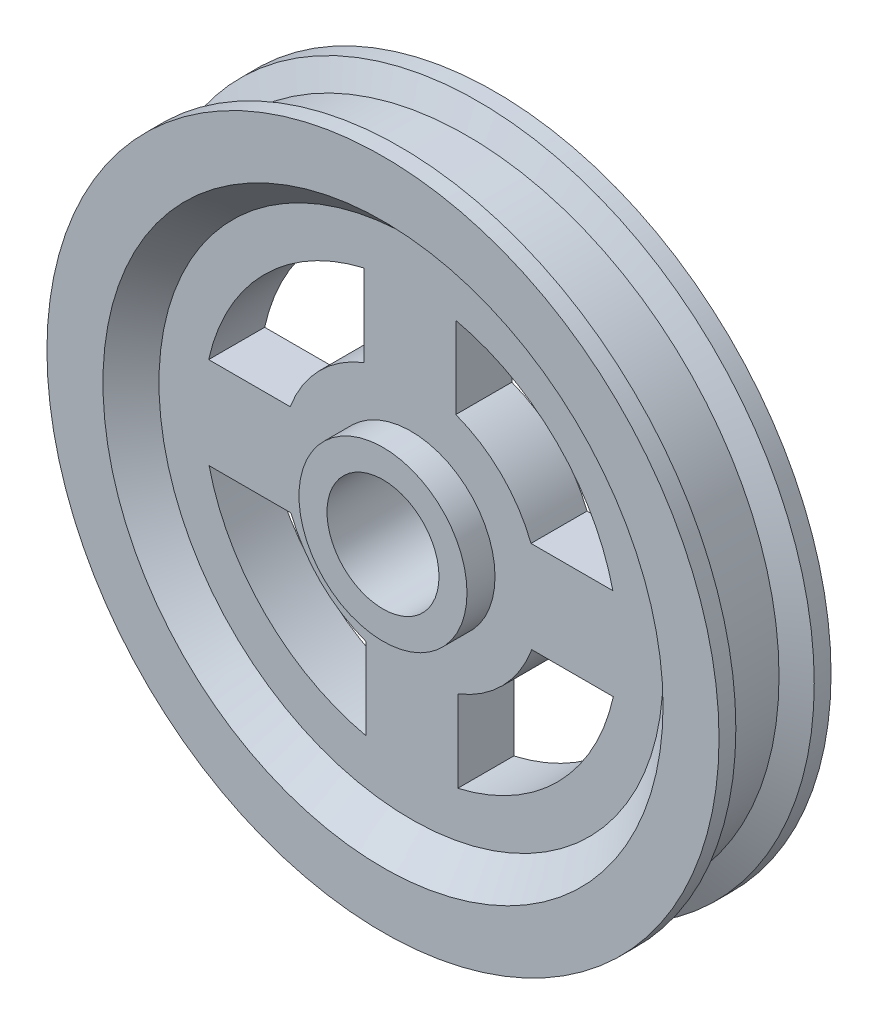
from build123d import *

# Parameters (mm, degrees)
CUT_EXTRUDE1_DEPTH = 10
CIRPATTERN1_COUNT  = 4


with BuildPart() as part:
    # Sketch1 → Revolve1 (revolve)
    with BuildSketch(Plane(origin=(0, 0, 0), x_dir=(0, 0, -1), z_dir=(1, 0, 0)), mode=Mode.PRIVATE) as revolve1_sk:
        Polygon((-5, 15), (-5, 45), (-10, 50), (-10, 60), (-7, 60), (-5, 55.710986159), (5, 55.710986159), (7, 60), (10, 60), (10, 50), (5, 45), (5, 15), (10, 15), (10, 10), (-10, 10), (-10, 15), align=None)
    revolve(revolve1_sk.sketch.rotate(Axis((0, 0, 25.740314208), (0, 0, -1)), 90), axis=Axis((0, 0, 25.740314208), (0, 0, -1)))

    # Sketch2 → Cut-Extrude1 (cut)
    with BuildSketch(Plane(origin=(0, 0, -5), x_dir=(-1, 0, 0), z_dir=(0, 0, -1))):
        with BuildLine():
            Line((-36.044238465, 8.355409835), (-21.428651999, 8.355409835))
            ThreePointArc((-21.428651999, 8.355409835), (-16.128458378, 16.397342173), (-8, 21.563858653))
            Line((-8, 21.563858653), (-8, 36.124783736))
            ThreePointArc((-8, 36.124783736), (-26.033790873, 26.291476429), (-36.044238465, 8.355409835))
        make_face()
    cut_extrude1 = extrude(amount=-CUT_EXTRUDE1_DEPTH, mode=Mode.SUBTRACT)

    # CirPattern1: Cut-Extrude1 ×4 about axis
    cirpattern1_axis = Axis((0, 0, 0), (0, 0, 1))
    for i in range(1, CIRPATTERN1_COUNT):
        add(cut_extrude1.rotate(cirpattern1_axis, i * 360 / CIRPATTERN1_COUNT), mode=Mode.SUBTRACT)


solid = part.part
